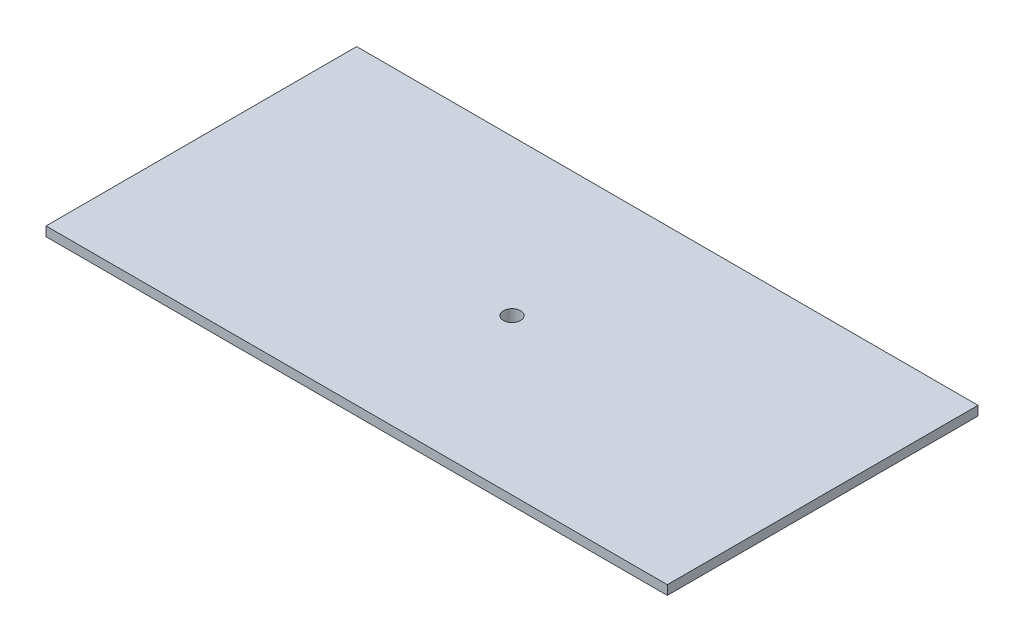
ISO-10303-21;
HEADER;
FILE_DESCRIPTION(('STEP AP214'),'2;1');
FILE_NAME('part.step','',(''),(''),'','','');
FILE_SCHEMA(('AUTOMOTIVE_DESIGN { 1 0 10303 214 1 1 1 1 }'));
ENDSEC;
DATA;
#1=APPLICATION_CONTEXT('core data for automotive mechanical design processes');
#2=APPLICATION_PROTOCOL_DEFINITION('international standard','automotive_design',2000,#1);
#3=PRODUCT_CONTEXT('',#1,'mechanical');
#4=PRODUCT('Part','Part','',(#3));
#5=PRODUCT_RELATED_PRODUCT_CATEGORY('part','',(#4));
#6=PRODUCT_DEFINITION_FORMATION('','',#4);
#7=PRODUCT_DEFINITION_CONTEXT('part definition',#1,'design');
#8=PRODUCT_DEFINITION('design','',#6,#7);
#9=PRODUCT_DEFINITION_SHAPE('','',#8);
#10=(LENGTH_UNIT() NAMED_UNIT(*) SI_UNIT(.MILLI.,.METRE.));
#11=(NAMED_UNIT(*) PLANE_ANGLE_UNIT() SI_UNIT($,.RADIAN.));
#12=(NAMED_UNIT(*) SI_UNIT($,.STERADIAN.) SOLID_ANGLE_UNIT());
#13=UNCERTAINTY_MEASURE_WITH_UNIT(LENGTH_MEASURE(1.E-05),#10,'distance_accuracy_value','');
#14=(GEOMETRIC_REPRESENTATION_CONTEXT(3) GLOBAL_UNCERTAINTY_ASSIGNED_CONTEXT((#13)) GLOBAL_UNIT_ASSIGNED_CONTEXT((#10,
#11,#12)) REPRESENTATION_CONTEXT('',''));
#15=CARTESIAN_POINT('',(0.,0.,0.));
#16=DIRECTION('',(0.,0.,1.));
#17=DIRECTION('',(1.,0.,0.));
#18=AXIS2_PLACEMENT_3D('',#15,#16,#17);
#19=CARTESIAN_POINT('',(0.,0.,0.));
#20=DIRECTION('',(0.,-1.,0.));
#21=DIRECTION('',(0.,0.,-1.));
#22=AXIS2_PLACEMENT_3D('',#19,#20,#21);
#23=PLANE('',#22);
#24=DIRECTION('',(0.,0.,-1.));
#25=VECTOR('',#24,1.);
#26=CARTESIAN_POINT('',(100.,0.,50.));
#27=LINE('',#26,#25);
#28=CARTESIAN_POINT('',(100.,0.,50.));
#29=VERTEX_POINT('',#28);
#30=CARTESIAN_POINT('',(100.,0.,-50.));
#31=VERTEX_POINT('',#30);
#32=EDGE_CURVE('E140',#29,#31,#27,.T.);
#33=ORIENTED_EDGE('',*,*,#32,.F.);
#34=DIRECTION('',(1.,0.,0.));
#35=VECTOR('',#34,1.);
#36=CARTESIAN_POINT('',(-100.,0.,50.));
#37=LINE('',#36,#35);
#38=CARTESIAN_POINT('',(-100.,0.,50.));
#39=VERTEX_POINT('',#38);
#40=EDGE_CURVE('E79',#39,#29,#37,.T.);
#41=ORIENTED_EDGE('',*,*,#40,.F.);
#42=DIRECTION('',(0.,0.,1.));
#43=VECTOR('',#42,1.);
#44=CARTESIAN_POINT('',(-100.,0.,50.));
#45=LINE('',#44,#43);
#46=CARTESIAN_POINT('',(-100.,0.,-50.));
#47=VERTEX_POINT('',#46);
#48=EDGE_CURVE('E152',#47,#39,#45,.T.);
#49=ORIENTED_EDGE('',*,*,#48,.F.);
#50=DIRECTION('',(-1.,0.,0.));
#51=VECTOR('',#50,1.);
#52=CARTESIAN_POINT('',(-100.,0.,-50.));
#53=LINE('',#52,#51);
#54=EDGE_CURVE('E150',#31,#47,#53,.T.);
#55=ORIENTED_EDGE('',*,*,#54,.F.);
#56=EDGE_LOOP('',(#33,#41,#49,#55));
#57=FACE_BOUND('',#56,.T.);
#58=CARTESIAN_POINT('',(0.,0.,0.));
#59=DIRECTION('',(0.,-1.,0.));
#60=DIRECTION('',(0.,0.,-1.));
#61=AXIS2_PLACEMENT_3D('',#58,#59,#60);
#62=CIRCLE('',#61,5.);
#63=CARTESIAN_POINT('',(0.,0.,-5.));
#64=VERTEX_POINT('',#63);
#65=EDGE_CURVE('E295',#64,#64,#62,.T.);
#66=ORIENTED_EDGE('',*,*,#65,.F.);
#67=EDGE_LOOP('',(#66));
#68=FACE_BOUND('',#67,.T.);
#69=ADVANCED_FACE('F35',(#57,#68),#23,.T.);
#70=CARTESIAN_POINT('',(100.,3.,50.));
#71=DIRECTION('',(-1.,0.,0.));
#72=DIRECTION('',(0.,0.,1.));
#73=AXIS2_PLACEMENT_3D('',#70,#71,#72);
#74=PLANE('',#73);
#75=ORIENTED_EDGE('',*,*,#32,.T.);
#76=DIRECTION('',(0.,-1.,0.));
#77=VECTOR('',#76,1.);
#78=CARTESIAN_POINT('',(100.,3.,-50.));
#79=LINE('',#78,#77);
#80=CARTESIAN_POINT('',(100.,3.,-50.));
#81=VERTEX_POINT('',#80);
#82=EDGE_CURVE('E43',#81,#31,#79,.T.);
#83=ORIENTED_EDGE('',*,*,#82,.F.);
#84=DIRECTION('',(0.,0.,-1.));
#85=VECTOR('',#84,1.);
#86=CARTESIAN_POINT('',(100.,3.,50.));
#87=LINE('',#86,#85);
#88=CARTESIAN_POINT('',(100.,3.,50.));
#89=VERTEX_POINT('',#88);
#90=EDGE_CURVE('E141',#89,#81,#87,.T.);
#91=ORIENTED_EDGE('',*,*,#90,.F.);
#92=DIRECTION('',(0.,-1.,0.));
#93=VECTOR('',#92,1.);
#94=CARTESIAN_POINT('',(100.,3.,50.));
#95=LINE('',#94,#93);
#96=EDGE_CURVE('E147',#89,#29,#95,.T.);
#97=ORIENTED_EDGE('',*,*,#96,.T.);
#98=EDGE_LOOP('',(#75,#83,#91,#97));
#99=FACE_BOUND('',#98,.T.);
#100=ADVANCED_FACE('F37',(#99),#74,.F.);
#101=CARTESIAN_POINT('',(-100.,3.,-50.));
#102=DIRECTION('',(0.,0.,1.));
#103=DIRECTION('',(1.,0.,0.));
#104=AXIS2_PLACEMENT_3D('',#101,#102,#103);
#105=PLANE('',#104);
#106=ORIENTED_EDGE('',*,*,#54,.T.);
#107=DIRECTION('',(0.,-1.,0.));
#108=VECTOR('',#107,1.);
#109=CARTESIAN_POINT('',(-100.,3.,-50.));
#110=LINE('',#109,#108);
#111=CARTESIAN_POINT('',(-100.,3.,-50.));
#112=VERTEX_POINT('',#111);
#113=EDGE_CURVE('E158',#112,#47,#110,.T.);
#114=ORIENTED_EDGE('',*,*,#113,.F.);
#115=DIRECTION('',(-1.,0.,0.));
#116=VECTOR('',#115,1.);
#117=CARTESIAN_POINT('',(-100.,3.,-50.));
#118=LINE('',#117,#116);
#119=EDGE_CURVE('E87',#81,#112,#118,.T.);
#120=ORIENTED_EDGE('',*,*,#119,.F.);
#121=ORIENTED_EDGE('',*,*,#82,.T.);
#122=EDGE_LOOP('',(#106,#114,#120,#121));
#123=FACE_BOUND('',#122,.T.);
#124=ADVANCED_FACE('F161',(#123),#105,.F.);
#125=CARTESIAN_POINT('',(-100.,3.,50.));
#126=DIRECTION('',(1.,0.,0.));
#127=DIRECTION('',(0.,0.,-1.));
#128=AXIS2_PLACEMENT_3D('',#125,#126,#127);
#129=PLANE('',#128);
#130=ORIENTED_EDGE('',*,*,#48,.T.);
#131=DIRECTION('',(0.,-1.,0.));
#132=VECTOR('',#131,1.);
#133=CARTESIAN_POINT('',(-100.,3.,50.));
#134=LINE('',#133,#132);
#135=CARTESIAN_POINT('',(-100.,3.,50.));
#136=VERTEX_POINT('',#135);
#137=EDGE_CURVE('E156',#136,#39,#134,.T.);
#138=ORIENTED_EDGE('',*,*,#137,.F.);
#139=DIRECTION('',(0.,0.,1.));
#140=VECTOR('',#139,1.);
#141=CARTESIAN_POINT('',(-100.,3.,50.));
#142=LINE('',#141,#140);
#143=EDGE_CURVE('E144',#112,#136,#142,.T.);
#144=ORIENTED_EDGE('',*,*,#143,.F.);
#145=ORIENTED_EDGE('',*,*,#113,.T.);
#146=EDGE_LOOP('',(#130,#138,#144,#145));
#147=FACE_BOUND('',#146,.T.);
#148=ADVANCED_FACE('F170',(#147),#129,.F.);
#149=CARTESIAN_POINT('',(-100.,3.,50.));
#150=DIRECTION('',(0.,0.,-1.));
#151=DIRECTION('',(-1.,0.,0.));
#152=AXIS2_PLACEMENT_3D('',#149,#150,#151);
#153=PLANE('',#152);
#154=ORIENTED_EDGE('',*,*,#40,.T.);
#155=ORIENTED_EDGE('',*,*,#96,.F.);
#156=DIRECTION('',(1.,0.,0.));
#157=VECTOR('',#156,1.);
#158=CARTESIAN_POINT('',(-100.,3.,50.));
#159=LINE('',#158,#157);
#160=EDGE_CURVE('E58',#136,#89,#159,.T.);
#161=ORIENTED_EDGE('',*,*,#160,.F.);
#162=ORIENTED_EDGE('',*,*,#137,.T.);
#163=EDGE_LOOP('',(#154,#155,#161,#162));
#164=FACE_BOUND('',#163,.T.);
#165=ADVANCED_FACE('F172',(#164),#153,.F.);
#166=CARTESIAN_POINT('',(0.,3.,0.));
#167=DIRECTION('',(0.,-1.,0.));
#168=DIRECTION('',(0.,0.,-1.));
#169=AXIS2_PLACEMENT_3D('',#166,#167,#168);
#170=PLANE('',#169);
#171=CARTESIAN_POINT('',(0.,3.,0.));
#172=DIRECTION('',(0.,1.,0.));
#173=DIRECTION('',(0.,0.,1.));
#174=AXIS2_PLACEMENT_3D('',#171,#172,#173);
#175=CIRCLE('',#174,2.75);
#176=CARTESIAN_POINT('',(0.,3.,2.75));
#177=VERTEX_POINT('',#176);
#178=EDGE_CURVE('E137',#177,#177,#175,.T.);
#179=ORIENTED_EDGE('',*,*,#178,.F.);
#180=EDGE_LOOP('',(#179));
#181=FACE_BOUND('',#180,.T.);
#182=ORIENTED_EDGE('',*,*,#90,.T.);
#183=ORIENTED_EDGE('',*,*,#119,.T.);
#184=ORIENTED_EDGE('',*,*,#143,.T.);
#185=ORIENTED_EDGE('',*,*,#160,.T.);
#186=EDGE_LOOP('',(#182,#183,#184,#185));
#187=FACE_BOUND('',#186,.T.);
#188=ADVANCED_FACE('F173',(#181,#187),#170,.F.);
#189=CARTESIAN_POINT('',(0.,-7.77817459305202,0.));
#190=DIRECTION('',(0.,1.,0.));
#191=DIRECTION('',(0.,0.,1.));
#192=AXIS2_PLACEMENT_3D('',#189,#190,#191);
#193=CYLINDRICAL_SURFACE('',#192,2.75);
#194=CARTESIAN_POINT('',(0.,-6.,0.));
#195=DIRECTION('',(0.,-1.,0.));
#196=DIRECTION('',(0.,0.,-1.));
#197=AXIS2_PLACEMENT_3D('',#194,#195,#196);
#198=CIRCLE('',#197,2.75);
#199=CARTESIAN_POINT('',(0.,-6.,2.75));
#200=VERTEX_POINT('',#199);
#201=EDGE_CURVE('E301',#200,#200,#198,.T.);
#202=CARTESIAN_POINT('',(0.,-6.,2.75));
#203=CARTESIAN_POINT('',(0.,-5.90625,2.75));
#204=CARTESIAN_POINT('',(0.,-5.8125,2.75));
#205=CARTESIAN_POINT('',(0.,-5.625,2.75));
#206=CARTESIAN_POINT('',(0.,-5.53125,2.75));
#207=CARTESIAN_POINT('',(0.,-5.34375,2.75));
#208=CARTESIAN_POINT('',(0.,-5.25,2.75));
#209=CARTESIAN_POINT('',(0.,-5.0625,2.75));
#210=CARTESIAN_POINT('',(0.,-4.96875,2.75));
#211=CARTESIAN_POINT('',(0.,-4.78125,2.75));
#212=CARTESIAN_POINT('',(0.,-4.6875,2.75));
#213=CARTESIAN_POINT('',(0.,-4.5,2.75));
#214=CARTESIAN_POINT('',(0.,-4.40625,2.75));
#215=CARTESIAN_POINT('',(0.,-4.21875,2.75));
#216=CARTESIAN_POINT('',(0.,-4.125,2.75));
#217=CARTESIAN_POINT('',(0.,-3.9375,2.75));
#218=CARTESIAN_POINT('',(0.,-3.84375,2.75));
#219=CARTESIAN_POINT('',(0.,-3.65625,2.75));
#220=CARTESIAN_POINT('',(0.,-3.5625,2.75));
#221=CARTESIAN_POINT('',(0.,-3.375,2.75));
#222=CARTESIAN_POINT('',(0.,-3.28125,2.75));
#223=CARTESIAN_POINT('',(0.,-3.09375,2.75));
#224=CARTESIAN_POINT('',(0.,-3.,2.75));
#225=CARTESIAN_POINT('',(0.,-2.8125,2.75));
#226=CARTESIAN_POINT('',(0.,-2.71875,2.75));
#227=CARTESIAN_POINT('',(0.,-2.53125,2.75));
#228=CARTESIAN_POINT('',(0.,-2.4375,2.75));
#229=CARTESIAN_POINT('',(0.,-2.25,2.75));
#230=CARTESIAN_POINT('',(0.,-2.15625,2.75));
#231=CARTESIAN_POINT('',(0.,-1.96875,2.75));
#232=CARTESIAN_POINT('',(0.,-1.875,2.75));
#233=CARTESIAN_POINT('',(0.,-1.6875,2.75));
#234=CARTESIAN_POINT('',(0.,-1.59375,2.75));
#235=CARTESIAN_POINT('',(0.,-1.40625,2.75));
#236=CARTESIAN_POINT('',(0.,-1.3125,2.75));
#237=CARTESIAN_POINT('',(0.,-1.125,2.75));
#238=CARTESIAN_POINT('',(0.,-1.03125,2.75));
#239=CARTESIAN_POINT('',(0.,-0.843750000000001,2.75));
#240=CARTESIAN_POINT('',(0.,-0.750000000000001,2.75));
#241=CARTESIAN_POINT('',(0.,-0.5625,2.75));
#242=CARTESIAN_POINT('',(0.,-0.46875,2.75));
#243=CARTESIAN_POINT('',(0.,-0.28125,2.75));
#244=CARTESIAN_POINT('',(0.,-0.187500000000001,2.75));
#245=CARTESIAN_POINT('',(0.,0.,2.75));
#246=CARTESIAN_POINT('',(0.,0.0937499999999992,2.75));
#247=CARTESIAN_POINT('',(0.,0.281249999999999,2.75));
#248=CARTESIAN_POINT('',(0.,0.374999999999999,2.75));
#249=CARTESIAN_POINT('',(0.,0.562499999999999,2.75));
#250=CARTESIAN_POINT('',(0.,0.656249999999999,2.75));
#251=CARTESIAN_POINT('',(0.,0.843749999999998,2.75));
#252=CARTESIAN_POINT('',(0.,0.937499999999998,2.75));
#253=CARTESIAN_POINT('',(0.,1.125,2.75));
#254=CARTESIAN_POINT('',(0.,1.21875,2.75));
#255=CARTESIAN_POINT('',(0.,1.40625,2.75));
#256=CARTESIAN_POINT('',(0.,1.5,2.75));
#257=CARTESIAN_POINT('',(0.,1.6875,2.75));
#258=CARTESIAN_POINT('',(0.,1.78125,2.75));
#259=CARTESIAN_POINT('',(0.,1.96875,2.75));
#260=CARTESIAN_POINT('',(0.,2.0625,2.75));
#261=CARTESIAN_POINT('',(0.,2.25,2.75));
#262=CARTESIAN_POINT('',(0.,2.34375,2.75));
#263=CARTESIAN_POINT('',(0.,2.53125,2.75));
#264=CARTESIAN_POINT('',(0.,2.625,2.75));
#265=CARTESIAN_POINT('',(0.,2.8125,2.75));
#266=CARTESIAN_POINT('',(0.,2.90625,2.75));
#267=CARTESIAN_POINT('',(0.,3.,2.75));
#268=B_SPLINE_CURVE_WITH_KNOTS('',3,(#202,#203,#204,#205,#206,#207,#208,#209,#210,#211,#212,
#213,#214,#215,#216,#217,#218,#219,#220,#221,#222,#223,#224,#225,#226,#227,#228,#229,#230,#231,
#232,#233,#234,#235,#236,#237,#238,#239,#240,#241,#242,#243,#244,#245,#246,#247,#248,#249,#250,
#251,#252,#253,#254,#255,#256,#257,#258,#259,#260,#261,#262,#263,#264,#265,#266,#267),
.UNSPECIFIED.,.F.,.F.,(4,2,2,2,2,2,2,2,2,2,2,2,2,2,2,2,2,2,2,2,2,2,2,2,2,2,2,2,2,2,2,2,4),(0.,
0.281249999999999,0.5625,0.84375,1.125,1.40625,1.6875,1.96875,2.25,2.53125,2.8125,3.09375,3.375,
3.65625,3.9375,4.21875,4.5,4.78125,5.0625,5.34375,5.625,5.90625,6.1875,6.46875,6.75,7.03125,
7.3125,7.59375,7.875,8.15625,8.4375,8.71875,9.),.UNSPECIFIED.);
#269=EDGE_CURVE('BSEAM175',#200,#177,#268,.T.);
#270=ORIENTED_EDGE('',*,*,#201,.T.);
#271=ORIENTED_EDGE('',*,*,#178,.T.);
#272=ORIENTED_EDGE('',*,*,#269,.T.);
#273=ORIENTED_EDGE('',*,*,#269,.F.);
#274=EDGE_LOOP('',(#270,#272,#271,#273));
#275=FACE_BOUND('',#274,.T.);
#276=ADVANCED_FACE('F175',(#275),#193,.F.);
#277=CARTESIAN_POINT('',(0.,-6.,0.));
#278=DIRECTION('',(0.,1.,0.));
#279=DIRECTION('',(0.,0.,1.));
#280=AXIS2_PLACEMENT_3D('',#277,#278,#279);
#281=PLANE('',#280);
#282=DIRECTION('',(0.,0.,1.));
#283=VECTOR('',#282,1.);
#284=CARTESIAN_POINT('',(3.5,-6.,-3.5));
#285=LINE('',#284,#283);
#286=CARTESIAN_POINT('',(3.5,-6.,-3.5));
#287=VERTEX_POINT('',#286);
#288=CARTESIAN_POINT('',(3.5,-6.,3.5));
#289=VERTEX_POINT('',#288);
#290=EDGE_CURVE('E304',#287,#289,#285,.T.);
#291=ORIENTED_EDGE('',*,*,#290,.T.);
#292=DIRECTION('',(-1.,0.,0.));
#293=VECTOR('',#292,1.);
#294=CARTESIAN_POINT('',(-3.5,-6.,3.5));
#295=LINE('',#294,#293);
#296=CARTESIAN_POINT('',(-3.5,-6.,3.5));
#297=VERTEX_POINT('',#296);
#298=EDGE_CURVE('E307',#289,#297,#295,.T.);
#299=ORIENTED_EDGE('',*,*,#298,.T.);
#300=DIRECTION('',(0.,0.,-1.));
#301=VECTOR('',#300,1.);
#302=CARTESIAN_POINT('',(-3.5,-6.,-3.5));
#303=LINE('',#302,#301);
#304=CARTESIAN_POINT('',(-3.5,-6.,-3.5));
#305=VERTEX_POINT('',#304);
#306=EDGE_CURVE('E309',#297,#305,#303,.T.);
#307=ORIENTED_EDGE('',*,*,#306,.T.);
#308=DIRECTION('',(1.,0.,0.));
#309=VECTOR('',#308,1.);
#310=CARTESIAN_POINT('',(-3.5,-6.,-3.5));
#311=LINE('',#310,#309);
#312=EDGE_CURVE('E127',#305,#287,#311,.T.);
#313=ORIENTED_EDGE('',*,*,#312,.T.);
#314=EDGE_LOOP('',(#291,#299,#307,#313));
#315=FACE_BOUND('',#314,.T.);
#316=ORIENTED_EDGE('',*,*,#201,.F.);
#317=EDGE_LOOP('',(#316));
#318=FACE_BOUND('',#317,.T.);
#319=ADVANCED_FACE('F182',(#315,#318),#281,.F.);
#320=CARTESIAN_POINT('',(3.5,-6.,-3.5));
#321=DIRECTION('',(-1.,0.,0.));
#322=DIRECTION('',(0.,0.,1.));
#323=AXIS2_PLACEMENT_3D('',#320,#321,#322);
#324=PLANE('',#323);
#325=DIRECTION('',(0.,1.,0.));
#326=VECTOR('',#325,1.);
#327=CARTESIAN_POINT('',(3.5,-6.,-3.5));
#328=LINE('',#327,#326);
#329=CARTESIAN_POINT('',(3.5,-1.5,-3.5));
#330=VERTEX_POINT('',#329);
#331=EDGE_CURVE('E128',#287,#330,#328,.T.);
#332=ORIENTED_EDGE('',*,*,#331,.T.);
#333=DIRECTION('',(0.,0.,1.));
#334=VECTOR('',#333,1.);
#335=CARTESIAN_POINT('',(3.5,-1.5,-3.5));
#336=LINE('',#335,#334);
#337=CARTESIAN_POINT('',(3.5,-1.5,3.5));
#338=VERTEX_POINT('',#337);
#339=EDGE_CURVE('E50',#330,#338,#336,.T.);
#340=ORIENTED_EDGE('',*,*,#339,.T.);
#341=DIRECTION('',(0.,1.,0.));
#342=VECTOR('',#341,1.);
#343=CARTESIAN_POINT('',(3.5,-6.,3.5));
#344=LINE('',#343,#342);
#345=EDGE_CURVE('E130',#289,#338,#344,.T.);
#346=ORIENTED_EDGE('',*,*,#345,.F.);
#347=ORIENTED_EDGE('',*,*,#290,.F.);
#348=EDGE_LOOP('',(#332,#340,#346,#347));
#349=FACE_BOUND('',#348,.T.);
#350=ADVANCED_FACE('F220',(#349),#324,.F.);
#351=CARTESIAN_POINT('',(-3.5,-6.,3.5));
#352=DIRECTION('',(0.,0.,-1.));
#353=DIRECTION('',(-1.,0.,0.));
#354=AXIS2_PLACEMENT_3D('',#351,#352,#353);
#355=PLANE('',#354);
#356=ORIENTED_EDGE('',*,*,#345,.T.);
#357=DIRECTION('',(-1.,0.,0.));
#358=VECTOR('',#357,1.);
#359=CARTESIAN_POINT('',(-3.5,-1.5,3.5));
#360=LINE('',#359,#358);
#361=CARTESIAN_POINT('',(-3.5,-1.5,3.5));
#362=VERTEX_POINT('',#361);
#363=EDGE_CURVE('E123',#338,#362,#360,.T.);
#364=ORIENTED_EDGE('',*,*,#363,.T.);
#365=DIRECTION('',(0.,1.,0.));
#366=VECTOR('',#365,1.);
#367=CARTESIAN_POINT('',(-3.5,-6.,3.5));
#368=LINE('',#367,#366);
#369=EDGE_CURVE('E122',#297,#362,#368,.T.);
#370=ORIENTED_EDGE('',*,*,#369,.F.);
#371=ORIENTED_EDGE('',*,*,#298,.F.);
#372=EDGE_LOOP('',(#356,#364,#370,#371));
#373=FACE_BOUND('',#372,.T.);
#374=ADVANCED_FACE('F243',(#373),#355,.F.);
#375=CARTESIAN_POINT('',(-3.5,-6.,-3.5));
#376=DIRECTION('',(1.,0.,0.));
#377=DIRECTION('',(0.,0.,-1.));
#378=AXIS2_PLACEMENT_3D('',#375,#376,#377);
#379=PLANE('',#378);
#380=ORIENTED_EDGE('',*,*,#369,.T.);
#381=DIRECTION('',(0.,0.,-1.));
#382=VECTOR('',#381,1.);
#383=CARTESIAN_POINT('',(-3.5,-1.5,-3.5));
#384=LINE('',#383,#382);
#385=CARTESIAN_POINT('',(-3.5,-1.5,-3.5));
#386=VERTEX_POINT('',#385);
#387=EDGE_CURVE('E108',#362,#386,#384,.T.);
#388=ORIENTED_EDGE('',*,*,#387,.T.);
#389=DIRECTION('',(0.,1.,0.));
#390=VECTOR('',#389,1.);
#391=CARTESIAN_POINT('',(-3.5,-6.,-3.5));
#392=LINE('',#391,#390);
#393=EDGE_CURVE('E119',#305,#386,#392,.T.);
#394=ORIENTED_EDGE('',*,*,#393,.F.);
#395=ORIENTED_EDGE('',*,*,#306,.F.);
#396=EDGE_LOOP('',(#380,#388,#394,#395));
#397=FACE_BOUND('',#396,.T.);
#398=ADVANCED_FACE('F117',(#397),#379,.F.);
#399=CARTESIAN_POINT('',(-3.5,-6.,-3.5));
#400=DIRECTION('',(0.,0.,1.));
#401=DIRECTION('',(1.,0.,0.));
#402=AXIS2_PLACEMENT_3D('',#399,#400,#401);
#403=PLANE('',#402);
#404=ORIENTED_EDGE('',*,*,#393,.T.);
#405=DIRECTION('',(1.,0.,0.));
#406=VECTOR('',#405,1.);
#407=CARTESIAN_POINT('',(-3.5,-1.5,-3.5));
#408=LINE('',#407,#406);
#409=EDGE_CURVE('E11',#386,#330,#408,.T.);
#410=ORIENTED_EDGE('',*,*,#409,.T.);
#411=ORIENTED_EDGE('',*,*,#331,.F.);
#412=ORIENTED_EDGE('',*,*,#312,.F.);
#413=EDGE_LOOP('',(#404,#410,#411,#412));
#414=FACE_BOUND('',#413,.T.);
#415=ADVANCED_FACE('F126',(#414),#403,.F.);
#416=CARTESIAN_POINT('',(0.,-1.5,0.));
#417=DIRECTION('',(0.,-1.,0.));
#418=DIRECTION('',(0.,0.,-1.));
#419=AXIS2_PLACEMENT_3D('',#416,#417,#418);
#420=PLANE('',#419);
#421=CARTESIAN_POINT('',(0.,-1.5,0.));
#422=DIRECTION('',(0.,-1.,0.));
#423=DIRECTION('',(0.,0.,-1.));
#424=AXIS2_PLACEMENT_3D('',#421,#422,#423);
#425=CIRCLE('',#424,5.);
#426=CARTESIAN_POINT('',(0.,-1.5,-5.));
#427=VERTEX_POINT('',#426);
#428=EDGE_CURVE('E124',#427,#427,#425,.T.);
#429=ORIENTED_EDGE('',*,*,#428,.T.);
#430=EDGE_LOOP('',(#429));
#431=FACE_BOUND('',#430,.T.);
#432=ORIENTED_EDGE('',*,*,#339,.F.);
#433=ORIENTED_EDGE('',*,*,#409,.F.);
#434=ORIENTED_EDGE('',*,*,#387,.F.);
#435=ORIENTED_EDGE('',*,*,#363,.F.);
#436=EDGE_LOOP('',(#432,#433,#434,#435));
#437=FACE_BOUND('',#436,.T.);
#438=ADVANCED_FACE('F107',(#431,#437),#420,.T.);
#439=CARTESIAN_POINT('',(0.,-1.5,0.));
#440=DIRECTION('',(0.,1.,0.));
#441=DIRECTION('',(0.,0.,1.));
#442=AXIS2_PLACEMENT_3D('',#439,#440,#441);
#443=CYLINDRICAL_SURFACE('',#442,5.);
#444=ORIENTED_EDGE('',*,*,#428,.F.);
#445=EDGE_LOOP('',(#444));
#446=FACE_BOUND('',#445,.T.);
#447=ORIENTED_EDGE('',*,*,#65,.T.);
#448=EDGE_LOOP('',(#447));
#449=FACE_BOUND('',#448,.T.);
#450=ADVANCED_FACE('F276',(#446,#449),#443,.T.);
#451=CLOSED_SHELL('',(#69,#100,#124,#148,#165,#188,#276,#319,#350,#374,#398,#415,#438,#450));
#452=MANIFOLD_SOLID_BREP('B2',#451);
#453=ADVANCED_BREP_SHAPE_REPRESENTATION('',(#18,#452),#14);
#454=SHAPE_DEFINITION_REPRESENTATION(#9,#453);
ENDSEC;
END-ISO-10303-21;
